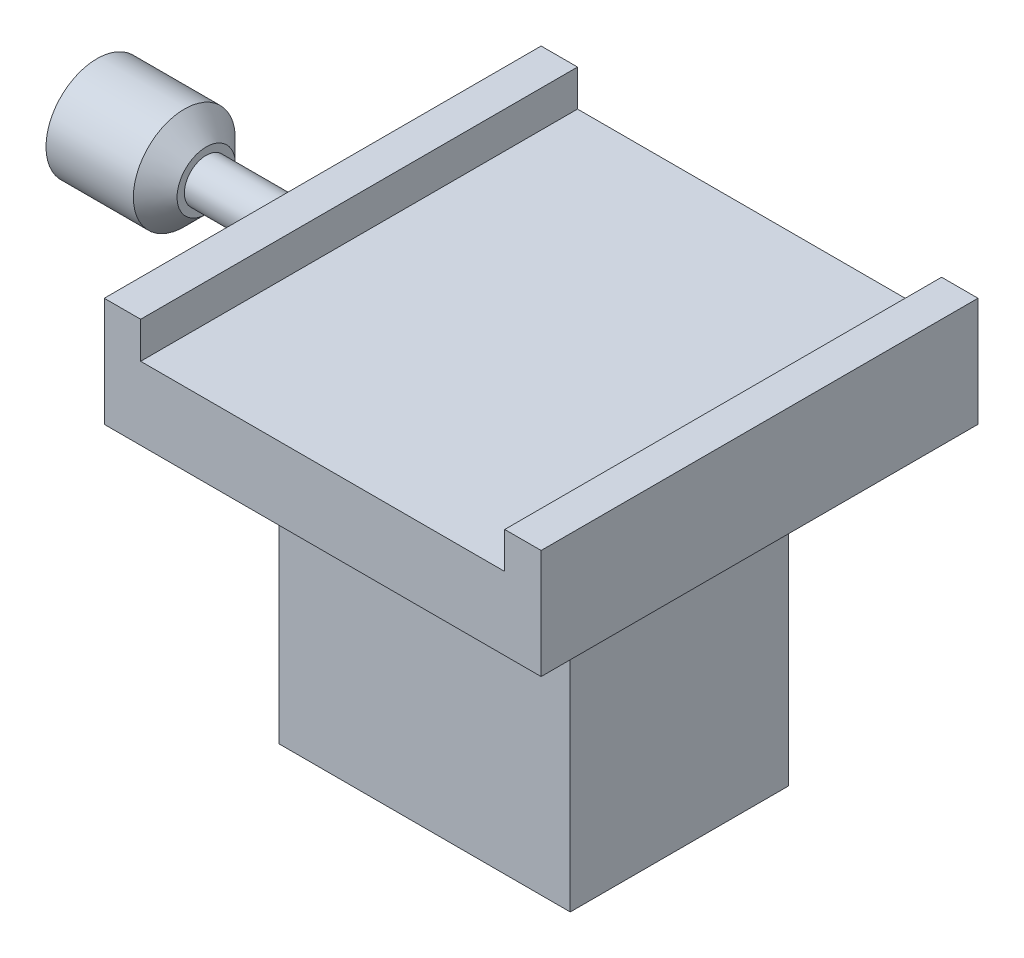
ISO-10303-21;
HEADER;
FILE_DESCRIPTION(('STEP AP214'),'2;1');
FILE_NAME('part.step','',(''),(''),'','','');
FILE_SCHEMA(('AUTOMOTIVE_DESIGN { 1 0 10303 214 1 1 1 1 }'));
ENDSEC;
DATA;
#1=APPLICATION_CONTEXT('core data for automotive mechanical design processes');
#2=APPLICATION_PROTOCOL_DEFINITION('international standard','automotive_design',2000,#1);
#3=PRODUCT_CONTEXT('',#1,'mechanical');
#4=PRODUCT('Part','Part','',(#3));
#5=PRODUCT_RELATED_PRODUCT_CATEGORY('part','',(#4));
#6=PRODUCT_DEFINITION_FORMATION('','',#4);
#7=PRODUCT_DEFINITION_CONTEXT('part definition',#1,'design');
#8=PRODUCT_DEFINITION('design','',#6,#7);
#9=PRODUCT_DEFINITION_SHAPE('','',#8);
#10=(LENGTH_UNIT() NAMED_UNIT(*) SI_UNIT(.MILLI.,.METRE.));
#11=(NAMED_UNIT(*) PLANE_ANGLE_UNIT() SI_UNIT($,.RADIAN.));
#12=(NAMED_UNIT(*) SI_UNIT($,.STERADIAN.) SOLID_ANGLE_UNIT());
#13=UNCERTAINTY_MEASURE_WITH_UNIT(LENGTH_MEASURE(1.E-05),#10,'distance_accuracy_value','');
#14=(GEOMETRIC_REPRESENTATION_CONTEXT(3) GLOBAL_UNCERTAINTY_ASSIGNED_CONTEXT((#13)) GLOBAL_UNIT_ASSIGNED_CONTEXT((#10,
#11,#12)) REPRESENTATION_CONTEXT('',''));
#15=CARTESIAN_POINT('',(0.,0.,0.));
#16=DIRECTION('',(0.,0.,1.));
#17=DIRECTION('',(1.,0.,0.));
#18=AXIS2_PLACEMENT_3D('',#15,#16,#17);
#19=CARTESIAN_POINT('',(-60.,7.,0.));
#20=DIRECTION('',(1.,0.,0.));
#21=DIRECTION('',(0.,0.,-1.));
#22=AXIS2_PLACEMENT_3D('',#19,#20,#21);
#23=CYLINDRICAL_SURFACE('',#22,3.);
#24=CARTESIAN_POINT('',(-30.,7.,0.));
#25=DIRECTION('',(1.,0.,0.));
#26=DIRECTION('',(0.,0.,-1.));
#27=AXIS2_PLACEMENT_3D('',#24,#25,#26);
#28=CIRCLE('',#27,3.);
#29=CARTESIAN_POINT('',(-30.,7.,-3.));
#30=VERTEX_POINT('',#29);
#31=EDGE_CURVE('E155',#30,#30,#28,.T.);
#32=ORIENTED_EDGE('',*,*,#31,.F.);
#33=EDGE_LOOP('',(#32));
#34=FACE_BOUND('',#33,.T.);
#35=CARTESIAN_POINT('',(-45.,7.,0.));
#36=DIRECTION('',(-1.,0.,0.));
#37=DIRECTION('',(0.,0.,1.));
#38=AXIS2_PLACEMENT_3D('',#35,#36,#37);
#39=CIRCLE('',#38,3.);
#40=CARTESIAN_POINT('',(-45.,7.,3.));
#41=VERTEX_POINT('',#40);
#42=EDGE_CURVE('E158',#41,#41,#39,.F.);
#43=ORIENTED_EDGE('',*,*,#42,.T.);
#44=EDGE_LOOP('',(#43));
#45=FACE_BOUND('',#44,.T.);
#46=ADVANCED_FACE('F32',(#34,#45),#23,.T.);
#47=CARTESIAN_POINT('',(-20.,-40.,15.));
#48=DIRECTION('',(-1.,0.,0.));
#49=DIRECTION('',(0.,0.,1.));
#50=AXIS2_PLACEMENT_3D('',#47,#48,#49);
#51=PLANE('',#50);
#52=DIRECTION('',(0.,0.,1.));
#53=VECTOR('',#52,1.);
#54=CARTESIAN_POINT('',(-20.,0.,15.));
#55=LINE('',#54,#53);
#56=CARTESIAN_POINT('',(-20.,0.,-15.));
#57=VERTEX_POINT('',#56);
#58=CARTESIAN_POINT('',(-20.,0.,15.));
#59=VERTEX_POINT('',#58);
#60=EDGE_CURVE('E138',#57,#59,#55,.T.);
#61=ORIENTED_EDGE('',*,*,#60,.F.);
#62=DIRECTION('',(0.,1.,0.));
#63=VECTOR('',#62,1.);
#64=CARTESIAN_POINT('',(-20.,-40.,-15.));
#65=LINE('',#64,#63);
#66=CARTESIAN_POINT('',(-20.,-40.,-15.));
#67=VERTEX_POINT('',#66);
#68=EDGE_CURVE('E55',#67,#57,#65,.T.);
#69=ORIENTED_EDGE('',*,*,#68,.F.);
#70=DIRECTION('',(0.,0.,1.));
#71=VECTOR('',#70,1.);
#72=CARTESIAN_POINT('',(-20.,-40.,15.));
#73=LINE('',#72,#71);
#74=CARTESIAN_POINT('',(-20.,-40.,15.));
#75=VERTEX_POINT('',#74);
#76=EDGE_CURVE('E203',#67,#75,#73,.T.);
#77=ORIENTED_EDGE('',*,*,#76,.T.);
#78=DIRECTION('',(0.,1.,0.));
#79=VECTOR('',#78,1.);
#80=CARTESIAN_POINT('',(-20.,-40.,15.));
#81=LINE('',#80,#79);
#82=EDGE_CURVE('E215',#75,#59,#81,.T.);
#83=ORIENTED_EDGE('',*,*,#82,.T.);
#84=EDGE_LOOP('',(#61,#69,#77,#83));
#85=FACE_BOUND('',#84,.T.);
#86=ADVANCED_FACE('F250',(#85),#51,.T.);
#87=CARTESIAN_POINT('',(20.,-40.,-15.));
#88=DIRECTION('',(0.,0.,-1.));
#89=DIRECTION('',(-1.,0.,0.));
#90=AXIS2_PLACEMENT_3D('',#87,#88,#89);
#91=PLANE('',#90);
#92=DIRECTION('',(-1.,0.,0.));
#93=VECTOR('',#92,1.);
#94=CARTESIAN_POINT('',(20.,0.,-15.));
#95=LINE('',#94,#93);
#96=CARTESIAN_POINT('',(20.,0.,-15.));
#97=VERTEX_POINT('',#96);
#98=EDGE_CURVE('E206',#97,#57,#95,.T.);
#99=ORIENTED_EDGE('',*,*,#98,.F.);
#100=DIRECTION('',(0.,1.,0.));
#101=VECTOR('',#100,1.);
#102=CARTESIAN_POINT('',(20.,-40.,-15.));
#103=LINE('',#102,#101);
#104=CARTESIAN_POINT('',(20.,-40.,-15.));
#105=VERTEX_POINT('',#104);
#106=EDGE_CURVE('E223',#105,#97,#103,.T.);
#107=ORIENTED_EDGE('',*,*,#106,.F.);
#108=DIRECTION('',(-1.,0.,0.));
#109=VECTOR('',#108,1.);
#110=CARTESIAN_POINT('',(20.,-40.,-15.));
#111=LINE('',#110,#109);
#112=EDGE_CURVE('E212',#105,#67,#111,.T.);
#113=ORIENTED_EDGE('',*,*,#112,.T.);
#114=ORIENTED_EDGE('',*,*,#68,.T.);
#115=EDGE_LOOP('',(#99,#107,#113,#114));
#116=FACE_BOUND('',#115,.T.);
#117=ADVANCED_FACE('F256',(#116),#91,.T.);
#118=CARTESIAN_POINT('',(20.,-40.,15.));
#119=DIRECTION('',(1.,0.,0.));
#120=DIRECTION('',(0.,0.,-1.));
#121=AXIS2_PLACEMENT_3D('',#118,#119,#120);
#122=PLANE('',#121);
#123=DIRECTION('',(0.,0.,-1.));
#124=VECTOR('',#123,1.);
#125=CARTESIAN_POINT('',(20.,0.,15.));
#126=LINE('',#125,#124);
#127=CARTESIAN_POINT('',(20.,0.,15.));
#128=VERTEX_POINT('',#127);
#129=EDGE_CURVE('E219',#128,#97,#126,.T.);
#130=ORIENTED_EDGE('',*,*,#129,.F.);
#131=DIRECTION('',(0.,1.,0.));
#132=VECTOR('',#131,1.);
#133=CARTESIAN_POINT('',(20.,-40.,15.));
#134=LINE('',#133,#132);
#135=CARTESIAN_POINT('',(20.,-40.,15.));
#136=VERTEX_POINT('',#135);
#137=EDGE_CURVE('E226',#136,#128,#134,.T.);
#138=ORIENTED_EDGE('',*,*,#137,.F.);
#139=DIRECTION('',(0.,0.,-1.));
#140=VECTOR('',#139,1.);
#141=CARTESIAN_POINT('',(20.,-40.,15.));
#142=LINE('',#141,#140);
#143=EDGE_CURVE('E209',#136,#105,#142,.T.);
#144=ORIENTED_EDGE('',*,*,#143,.T.);
#145=ORIENTED_EDGE('',*,*,#106,.T.);
#146=EDGE_LOOP('',(#130,#138,#144,#145));
#147=FACE_BOUND('',#146,.T.);
#148=ADVANCED_FACE('F302',(#147),#122,.T.);
#149=CARTESIAN_POINT('',(20.,-40.,15.));
#150=DIRECTION('',(0.,0.,1.));
#151=DIRECTION('',(1.,0.,0.));
#152=AXIS2_PLACEMENT_3D('',#149,#150,#151);
#153=PLANE('',#152);
#154=DIRECTION('',(1.,0.,0.));
#155=VECTOR('',#154,1.);
#156=CARTESIAN_POINT('',(20.,0.,15.));
#157=LINE('',#156,#155);
#158=EDGE_CURVE('E217',#59,#128,#157,.T.);
#159=ORIENTED_EDGE('',*,*,#158,.F.);
#160=ORIENTED_EDGE('',*,*,#82,.F.);
#161=DIRECTION('',(1.,0.,0.));
#162=VECTOR('',#161,1.);
#163=CARTESIAN_POINT('',(20.,-40.,15.));
#164=LINE('',#163,#162);
#165=EDGE_CURVE('E205',#75,#136,#164,.T.);
#166=ORIENTED_EDGE('',*,*,#165,.T.);
#167=ORIENTED_EDGE('',*,*,#137,.T.);
#168=EDGE_LOOP('',(#159,#160,#166,#167));
#169=FACE_BOUND('',#168,.T.);
#170=ADVANCED_FACE('F298',(#169),#153,.T.);
#171=CARTESIAN_POINT('',(0.,-40.,0.));
#172=DIRECTION('',(0.,1.,0.));
#173=DIRECTION('',(0.,0.,1.));
#174=AXIS2_PLACEMENT_3D('',#171,#172,#173);
#175=PLANE('',#174);
#176=ORIENTED_EDGE('',*,*,#76,.F.);
#177=ORIENTED_EDGE('',*,*,#112,.F.);
#178=ORIENTED_EDGE('',*,*,#143,.F.);
#179=ORIENTED_EDGE('',*,*,#165,.F.);
#180=EDGE_LOOP('',(#176,#177,#178,#179));
#181=FACE_BOUND('',#180,.T.);
#182=ADVANCED_FACE('F292',(#181),#175,.F.);
#183=CARTESIAN_POINT('',(-30.,0.,29.));
#184=DIRECTION('',(0.,1.,0.));
#185=DIRECTION('',(0.,0.,1.));
#186=AXIS2_PLACEMENT_3D('',#183,#184,#185);
#187=PLANE('',#186);
#188=DIRECTION('',(1.,0.,0.));
#189=VECTOR('',#188,1.);
#190=CARTESIAN_POINT('',(-30.,0.,-31.));
#191=LINE('',#190,#189);
#192=CARTESIAN_POINT('',(-30.,0.,-31.));
#193=VERTEX_POINT('',#192);
#194=CARTESIAN_POINT('',(30.,0.,-31.));
#195=VERTEX_POINT('',#194);
#196=EDGE_CURVE('E132',#193,#195,#191,.T.);
#197=ORIENTED_EDGE('',*,*,#196,.T.);
#198=DIRECTION('',(0.,0.,-1.));
#199=VECTOR('',#198,1.);
#200=CARTESIAN_POINT('',(30.,0.,29.));
#201=LINE('',#200,#199);
#202=CARTESIAN_POINT('',(30.,0.,29.));
#203=VERTEX_POINT('',#202);
#204=EDGE_CURVE('E139',#203,#195,#201,.T.);
#205=ORIENTED_EDGE('',*,*,#204,.F.);
#206=DIRECTION('',(1.,0.,0.));
#207=VECTOR('',#206,1.);
#208=CARTESIAN_POINT('',(-30.,0.,29.));
#209=LINE('',#208,#207);
#210=CARTESIAN_POINT('',(-30.,0.,29.));
#211=VERTEX_POINT('',#210);
#212=EDGE_CURVE('E133',#211,#203,#209,.T.);
#213=ORIENTED_EDGE('',*,*,#212,.F.);
#214=DIRECTION('',(0.,0.,-1.));
#215=VECTOR('',#214,1.);
#216=CARTESIAN_POINT('',(-30.,0.,29.));
#217=LINE('',#216,#215);
#218=EDGE_CURVE('E127',#211,#193,#217,.T.);
#219=ORIENTED_EDGE('',*,*,#218,.T.);
#220=EDGE_LOOP('',(#197,#205,#213,#219));
#221=FACE_BOUND('',#220,.T.);
#222=ORIENTED_EDGE('',*,*,#129,.T.);
#223=ORIENTED_EDGE('',*,*,#98,.T.);
#224=ORIENTED_EDGE('',*,*,#60,.T.);
#225=ORIENTED_EDGE('',*,*,#158,.T.);
#226=EDGE_LOOP('',(#222,#223,#224,#225));
#227=FACE_BOUND('',#226,.T.);
#228=ADVANCED_FACE('F129',(#221,#227),#187,.F.);
#229=CARTESIAN_POINT('',(-30.,0.,29.));
#230=DIRECTION('',(1.,0.,0.));
#231=DIRECTION('',(0.,0.,-1.));
#232=AXIS2_PLACEMENT_3D('',#229,#230,#231);
#233=PLANE('',#232);
#234=ORIENTED_EDGE('',*,*,#31,.T.);
#235=EDGE_LOOP('',(#234));
#236=FACE_BOUND('',#235,.T.);
#237=DIRECTION('',(0.,0.,-1.));
#238=VECTOR('',#237,1.);
#239=CARTESIAN_POINT('',(-30.,15.,29.));
#240=LINE('',#239,#238);
#241=CARTESIAN_POINT('',(-30.,15.,29.));
#242=VERTEX_POINT('',#241);
#243=CARTESIAN_POINT('',(-30.,15.,-31.));
#244=VERTEX_POINT('',#243);
#245=EDGE_CURVE('E154',#242,#244,#240,.T.);
#246=ORIENTED_EDGE('',*,*,#245,.T.);
#247=DIRECTION('',(0.,-1.,0.));
#248=VECTOR('',#247,1.);
#249=CARTESIAN_POINT('',(-30.,0.,-31.));
#250=LINE('',#249,#248);
#251=EDGE_CURVE('E146',#244,#193,#250,.T.);
#252=ORIENTED_EDGE('',*,*,#251,.T.);
#253=ORIENTED_EDGE('',*,*,#218,.F.);
#254=DIRECTION('',(0.,-1.,0.));
#255=VECTOR('',#254,1.);
#256=CARTESIAN_POINT('',(-30.,0.,29.));
#257=LINE('',#256,#255);
#258=EDGE_CURVE('E176',#242,#211,#257,.T.);
#259=ORIENTED_EDGE('',*,*,#258,.F.);
#260=EDGE_LOOP('',(#246,#252,#253,#259));
#261=FACE_BOUND('',#260,.T.);
#262=ADVANCED_FACE('F152',(#236,#261),#233,.F.);
#263=CARTESIAN_POINT('',(30.,0.,29.));
#264=DIRECTION('',(-1.,0.,0.));
#265=DIRECTION('',(0.,0.,1.));
#266=AXIS2_PLACEMENT_3D('',#263,#264,#265);
#267=PLANE('',#266);
#268=ORIENTED_EDGE('',*,*,#204,.T.);
#269=DIRECTION('',(0.,1.,0.));
#270=VECTOR('',#269,1.);
#271=CARTESIAN_POINT('',(30.,0.,-31.));
#272=LINE('',#271,#270);
#273=CARTESIAN_POINT('',(30.,15.,-31.));
#274=VERTEX_POINT('',#273);
#275=EDGE_CURVE('E150',#195,#274,#272,.T.);
#276=ORIENTED_EDGE('',*,*,#275,.T.);
#277=DIRECTION('',(0.,0.,-1.));
#278=VECTOR('',#277,1.);
#279=CARTESIAN_POINT('',(30.,15.,29.));
#280=LINE('',#279,#278);
#281=CARTESIAN_POINT('',(30.,15.,29.));
#282=VERTEX_POINT('',#281);
#283=EDGE_CURVE('E200',#282,#274,#280,.T.);
#284=ORIENTED_EDGE('',*,*,#283,.F.);
#285=DIRECTION('',(0.,1.,0.));
#286=VECTOR('',#285,1.);
#287=CARTESIAN_POINT('',(30.,0.,29.));
#288=LINE('',#287,#286);
#289=EDGE_CURVE('E179',#203,#282,#288,.T.);
#290=ORIENTED_EDGE('',*,*,#289,.F.);
#291=EDGE_LOOP('',(#268,#276,#284,#290));
#292=FACE_BOUND('',#291,.T.);
#293=ADVANCED_FACE('F285',(#292),#267,.F.);
#294=CARTESIAN_POINT('',(25.,15.,29.));
#295=DIRECTION('',(0.,-1.,0.));
#296=DIRECTION('',(0.,0.,-1.));
#297=AXIS2_PLACEMENT_3D('',#294,#295,#296);
#298=PLANE('',#297);
#299=ORIENTED_EDGE('',*,*,#283,.T.);
#300=DIRECTION('',(-1.,0.,0.));
#301=VECTOR('',#300,1.);
#302=CARTESIAN_POINT('',(25.,15.,-31.));
#303=LINE('',#302,#301);
#304=CARTESIAN_POINT('',(25.,15.,-31.));
#305=VERTEX_POINT('',#304);
#306=EDGE_CURVE('E163',#274,#305,#303,.T.);
#307=ORIENTED_EDGE('',*,*,#306,.T.);
#308=DIRECTION('',(0.,0.,-1.));
#309=VECTOR('',#308,1.);
#310=CARTESIAN_POINT('',(25.,15.,29.));
#311=LINE('',#310,#309);
#312=CARTESIAN_POINT('',(25.,15.,29.));
#313=VERTEX_POINT('',#312);
#314=EDGE_CURVE('E198',#313,#305,#311,.T.);
#315=ORIENTED_EDGE('',*,*,#314,.F.);
#316=DIRECTION('',(-1.,0.,0.));
#317=VECTOR('',#316,1.);
#318=CARTESIAN_POINT('',(25.,15.,29.));
#319=LINE('',#318,#317);
#320=EDGE_CURVE('E181',#282,#313,#319,.T.);
#321=ORIENTED_EDGE('',*,*,#320,.F.);
#322=EDGE_LOOP('',(#299,#307,#315,#321));
#323=FACE_BOUND('',#322,.T.);
#324=ADVANCED_FACE('F281',(#323),#298,.F.);
#325=CARTESIAN_POINT('',(25.,15.,29.));
#326=DIRECTION('',(1.,0.,0.));
#327=DIRECTION('',(0.,1.,0.));
#328=AXIS2_PLACEMENT_3D('',#325,#326,#327);
#329=PLANE('',#328);
#330=ORIENTED_EDGE('',*,*,#314,.T.);
#331=DIRECTION('',(0.,-1.,0.));
#332=VECTOR('',#331,1.);
#333=CARTESIAN_POINT('',(25.,15.,-31.));
#334=LINE('',#333,#332);
#335=CARTESIAN_POINT('',(25.,10.,-31.));
#336=VERTEX_POINT('',#335);
#337=EDGE_CURVE('E166',#305,#336,#334,.T.);
#338=ORIENTED_EDGE('',*,*,#337,.T.);
#339=DIRECTION('',(0.,0.,-1.));
#340=VECTOR('',#339,1.);
#341=CARTESIAN_POINT('',(25.,10.,29.));
#342=LINE('',#341,#340);
#343=CARTESIAN_POINT('',(25.,10.,29.));
#344=VERTEX_POINT('',#343);
#345=EDGE_CURVE('E196',#344,#336,#342,.T.);
#346=ORIENTED_EDGE('',*,*,#345,.F.);
#347=DIRECTION('',(0.,-1.,0.));
#348=VECTOR('',#347,1.);
#349=CARTESIAN_POINT('',(25.,15.,29.));
#350=LINE('',#349,#348);
#351=EDGE_CURVE('E183',#313,#344,#350,.T.);
#352=ORIENTED_EDGE('',*,*,#351,.F.);
#353=EDGE_LOOP('',(#330,#338,#346,#352));
#354=FACE_BOUND('',#353,.T.);
#355=ADVANCED_FACE('F278',(#354),#329,.F.);
#356=CARTESIAN_POINT('',(-25.,10.,29.));
#357=DIRECTION('',(0.,-1.,0.));
#358=DIRECTION('',(0.,0.,-1.));
#359=AXIS2_PLACEMENT_3D('',#356,#357,#358);
#360=PLANE('',#359);
#361=ORIENTED_EDGE('',*,*,#345,.T.);
#362=DIRECTION('',(-1.,0.,0.));
#363=VECTOR('',#362,1.);
#364=CARTESIAN_POINT('',(-25.,10.,-31.));
#365=LINE('',#364,#363);
#366=CARTESIAN_POINT('',(-25.,10.,-31.));
#367=VERTEX_POINT('',#366);
#368=EDGE_CURVE('E169',#336,#367,#365,.T.);
#369=ORIENTED_EDGE('',*,*,#368,.T.);
#370=DIRECTION('',(0.,0.,-1.));
#371=VECTOR('',#370,1.);
#372=CARTESIAN_POINT('',(-25.,10.,29.));
#373=LINE('',#372,#371);
#374=CARTESIAN_POINT('',(-25.,10.,0.));
#375=VERTEX_POINT('',#374);
#376=EDGE_CURVE('E47',#375,#367,#373,.T.);
#377=ORIENTED_EDGE('',*,*,#376,.F.);
#378=CARTESIAN_POINT('',(-25.,10.,29.));
#379=VERTEX_POINT('',#378);
#380=EDGE_CURVE('E194',#379,#375,#373,.T.);
#381=ORIENTED_EDGE('',*,*,#380,.F.);
#382=DIRECTION('',(-1.,0.,0.));
#383=VECTOR('',#382,1.);
#384=CARTESIAN_POINT('',(-25.,10.,29.));
#385=LINE('',#384,#383);
#386=EDGE_CURVE('E185',#344,#379,#385,.T.);
#387=ORIENTED_EDGE('',*,*,#386,.F.);
#388=EDGE_LOOP('',(#361,#369,#377,#381,#387));
#389=FACE_BOUND('',#388,.T.);
#390=ADVANCED_FACE('F274',(#389),#360,.F.);
#391=CARTESIAN_POINT('',(-25.,15.,29.));
#392=DIRECTION('',(-1.,0.,0.));
#393=DIRECTION('',(0.,-1.,0.));
#394=AXIS2_PLACEMENT_3D('',#391,#392,#393);
#395=PLANE('',#394);
#396=ORIENTED_EDGE('',*,*,#380,.T.);
#397=ORIENTED_EDGE('',*,*,#376,.T.);
#398=DIRECTION('',(0.,1.,0.));
#399=VECTOR('',#398,1.);
#400=CARTESIAN_POINT('',(-25.,15.,-31.));
#401=LINE('',#400,#399);
#402=CARTESIAN_POINT('',(-25.,15.,-31.));
#403=VERTEX_POINT('',#402);
#404=EDGE_CURVE('E171',#367,#403,#401,.T.);
#405=ORIENTED_EDGE('',*,*,#404,.T.);
#406=DIRECTION('',(0.,0.,-1.));
#407=VECTOR('',#406,1.);
#408=CARTESIAN_POINT('',(-25.,15.,29.));
#409=LINE('',#408,#407);
#410=CARTESIAN_POINT('',(-25.,15.,29.));
#411=VERTEX_POINT('',#410);
#412=EDGE_CURVE('E192',#411,#403,#409,.T.);
#413=ORIENTED_EDGE('',*,*,#412,.F.);
#414=DIRECTION('',(0.,1.,0.));
#415=VECTOR('',#414,1.);
#416=CARTESIAN_POINT('',(-25.,15.,29.));
#417=LINE('',#416,#415);
#418=EDGE_CURVE('E187',#379,#411,#417,.T.);
#419=ORIENTED_EDGE('',*,*,#418,.F.);
#420=EDGE_LOOP('',(#396,#397,#405,#413,#419));
#421=FACE_BOUND('',#420,.T.);
#422=ADVANCED_FACE('F270',(#421),#395,.F.);
#423=CARTESIAN_POINT('',(-30.,15.,29.));
#424=DIRECTION('',(0.,-1.,0.));
#425=DIRECTION('',(0.,0.,-1.));
#426=AXIS2_PLACEMENT_3D('',#423,#424,#425);
#427=PLANE('',#426);
#428=ORIENTED_EDGE('',*,*,#412,.T.);
#429=DIRECTION('',(-1.,0.,0.));
#430=VECTOR('',#429,1.);
#431=CARTESIAN_POINT('',(-30.,15.,-31.));
#432=LINE('',#431,#430);
#433=EDGE_CURVE('E174',#403,#244,#432,.T.);
#434=ORIENTED_EDGE('',*,*,#433,.T.);
#435=ORIENTED_EDGE('',*,*,#245,.F.);
#436=DIRECTION('',(-1.,0.,0.));
#437=VECTOR('',#436,1.);
#438=CARTESIAN_POINT('',(-30.,15.,29.));
#439=LINE('',#438,#437);
#440=EDGE_CURVE('E189',#411,#242,#439,.T.);
#441=ORIENTED_EDGE('',*,*,#440,.F.);
#442=EDGE_LOOP('',(#428,#434,#435,#441));
#443=FACE_BOUND('',#442,.T.);
#444=ADVANCED_FACE('F266',(#443),#427,.F.);
#445=CARTESIAN_POINT('',(0.,0.,29.));
#446=DIRECTION('',(0.,0.,-1.));
#447=DIRECTION('',(-1.,0.,0.));
#448=AXIS2_PLACEMENT_3D('',#445,#446,#447);
#449=PLANE('',#448);
#450=ORIENTED_EDGE('',*,*,#258,.T.);
#451=ORIENTED_EDGE('',*,*,#212,.T.);
#452=ORIENTED_EDGE('',*,*,#289,.T.);
#453=ORIENTED_EDGE('',*,*,#320,.T.);
#454=ORIENTED_EDGE('',*,*,#351,.T.);
#455=ORIENTED_EDGE('',*,*,#386,.T.);
#456=ORIENTED_EDGE('',*,*,#418,.T.);
#457=ORIENTED_EDGE('',*,*,#440,.T.);
#458=EDGE_LOOP('',(#450,#451,#452,#453,#454,#455,#456,#457));
#459=FACE_BOUND('',#458,.T.);
#460=ADVANCED_FACE('F263',(#459),#449,.F.);
#461=CARTESIAN_POINT('',(0.,0.,-31.));
#462=DIRECTION('',(0.,0.,-1.));
#463=DIRECTION('',(-1.,0.,0.));
#464=AXIS2_PLACEMENT_3D('',#461,#462,#463);
#465=PLANE('',#464);
#466=ORIENTED_EDGE('',*,*,#251,.F.);
#467=ORIENTED_EDGE('',*,*,#433,.F.);
#468=ORIENTED_EDGE('',*,*,#404,.F.);
#469=ORIENTED_EDGE('',*,*,#368,.F.);
#470=ORIENTED_EDGE('',*,*,#337,.F.);
#471=ORIENTED_EDGE('',*,*,#306,.F.);
#472=ORIENTED_EDGE('',*,*,#275,.F.);
#473=ORIENTED_EDGE('',*,*,#196,.F.);
#474=EDGE_LOOP('',(#466,#467,#468,#469,#470,#471,#472,#473));
#475=FACE_BOUND('',#474,.T.);
#476=ADVANCED_FACE('F144',(#475),#465,.T.);
#477=CARTESIAN_POINT('',(-45.,7.,0.));
#478=DIRECTION('',(-1.,0.,0.));
#479=DIRECTION('',(0.,0.,1.));
#480=AXIS2_PLACEMENT_3D('',#477,#478,#479);
#481=CYLINDRICAL_SURFACE('',#480,7.);
#482=CARTESIAN_POINT('',(-48.,7.,0.));
#483=DIRECTION('',(-1.,0.,0.));
#484=DIRECTION('',(0.,0.,1.));
#485=AXIS2_PLACEMENT_3D('',#482,#483,#484);
#486=CIRCLE('',#485,7.);
#487=CARTESIAN_POINT('',(-48.,7.,7.));
#488=VERTEX_POINT('',#487);
#489=EDGE_CURVE('E40',#488,#488,#486,.T.);
#490=ORIENTED_EDGE('',*,*,#489,.T.);
#491=EDGE_LOOP('',(#490));
#492=FACE_BOUND('',#491,.T.);
#493=CARTESIAN_POINT('',(-60.,7.,0.));
#494=DIRECTION('',(-1.,0.,0.));
#495=DIRECTION('',(0.,0.,1.));
#496=AXIS2_PLACEMENT_3D('',#493,#494,#495);
#497=CIRCLE('',#496,7.);
#498=CARTESIAN_POINT('',(-60.,7.,7.));
#499=VERTEX_POINT('',#498);
#500=EDGE_CURVE('E232',#499,#499,#497,.T.);
#501=ORIENTED_EDGE('',*,*,#500,.F.);
#502=EDGE_LOOP('',(#501));
#503=FACE_BOUND('',#502,.T.);
#504=ADVANCED_FACE('F236',(#492,#503),#481,.T.);
#505=CARTESIAN_POINT('',(-45.,7.,0.));
#506=DIRECTION('',(-1.,0.,0.));
#507=DIRECTION('',(0.,0.,1.));
#508=AXIS2_PLACEMENT_3D('',#505,#506,#507);
#509=PLANE('',#508);
#510=CARTESIAN_POINT('',(-45.,7.,0.));
#511=DIRECTION('',(-1.,0.,0.));
#512=DIRECTION('',(0.,0.,1.));
#513=AXIS2_PLACEMENT_3D('',#510,#511,#512);
#514=CIRCLE('',#513,3.99999999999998);
#515=CARTESIAN_POINT('',(-45.,7.,3.99999999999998));
#516=VERTEX_POINT('',#515);
#517=EDGE_CURVE('E11',#516,#516,#514,.F.);
#518=ORIENTED_EDGE('',*,*,#517,.T.);
#519=EDGE_LOOP('',(#518));
#520=FACE_BOUND('',#519,.T.);
#521=ORIENTED_EDGE('',*,*,#42,.F.);
#522=EDGE_LOOP('',(#521));
#523=FACE_BOUND('',#522,.T.);
#524=ADVANCED_FACE('F245',(#520,#523),#509,.F.);
#525=CARTESIAN_POINT('',(-60.,7.,0.));
#526=DIRECTION('',(1.,0.,0.));
#527=DIRECTION('',(0.,0.,-1.));
#528=AXIS2_PLACEMENT_3D('',#525,#526,#527);
#529=PLANE('',#528);
#530=ORIENTED_EDGE('',*,*,#500,.T.);
#531=EDGE_LOOP('',(#530));
#532=FACE_BOUND('',#531,.T.);
#533=ADVANCED_FACE('F240',(#532),#529,.F.);
#534=CARTESIAN_POINT('',(-48.,7.,0.));
#535=DIRECTION('',(-1.,0.,0.));
#536=DIRECTION('',(0.,0.,1.));
#537=AXIS2_PLACEMENT_3D('',#534,#535,#536);
#538=CONICAL_SURFACE('',#537,7.,0.785398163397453);
#539=ORIENTED_EDGE('',*,*,#517,.F.);
#540=EDGE_LOOP('',(#539));
#541=FACE_BOUND('',#540,.T.);
#542=ORIENTED_EDGE('',*,*,#489,.F.);
#543=EDGE_LOOP('',(#542));
#544=FACE_BOUND('',#543,.T.);
#545=ADVANCED_FACE('F34',(#541,#544),#538,.T.);
#546=CLOSED_SHELL('',(#46,#86,#117,#148,#170,#182,#228,#262,#293,#324,#355,#390,#422,#444,#460,
#476,#504,#524,#533,#545));
#547=MANIFOLD_SOLID_BREP('B2',#546);
#548=ADVANCED_BREP_SHAPE_REPRESENTATION('',(#18,#547),#14);
#549=SHAPE_DEFINITION_REPRESENTATION(#9,#548);
ENDSEC;
END-ISO-10303-21;
